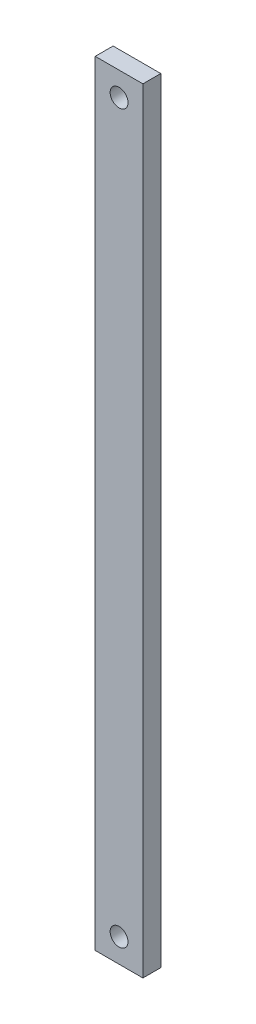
from build123d import *

# Parameters (mm, degrees)
ESQUISSE1_W      = 8
ESQUISSE1_H      = 130
ESQUISSE1_R      = 1.5
EXTRUSION1_DEPTH = 3


with BuildPart() as part:
    # Esquisse1 → Extrusion1 (new body)
    with BuildSketch(Plane.XY):
        with Locations((0, 61)):
            Rectangle(ESQUISSE1_W, ESQUISSE1_H)
        Circle(ESQUISSE1_R, mode=Mode.SUBTRACT)
        with Locations((0, 122)):
            Circle(ESQUISSE1_R, mode=Mode.SUBTRACT)
    extrude(amount=EXTRUSION1_DEPTH)


solid = part.part
